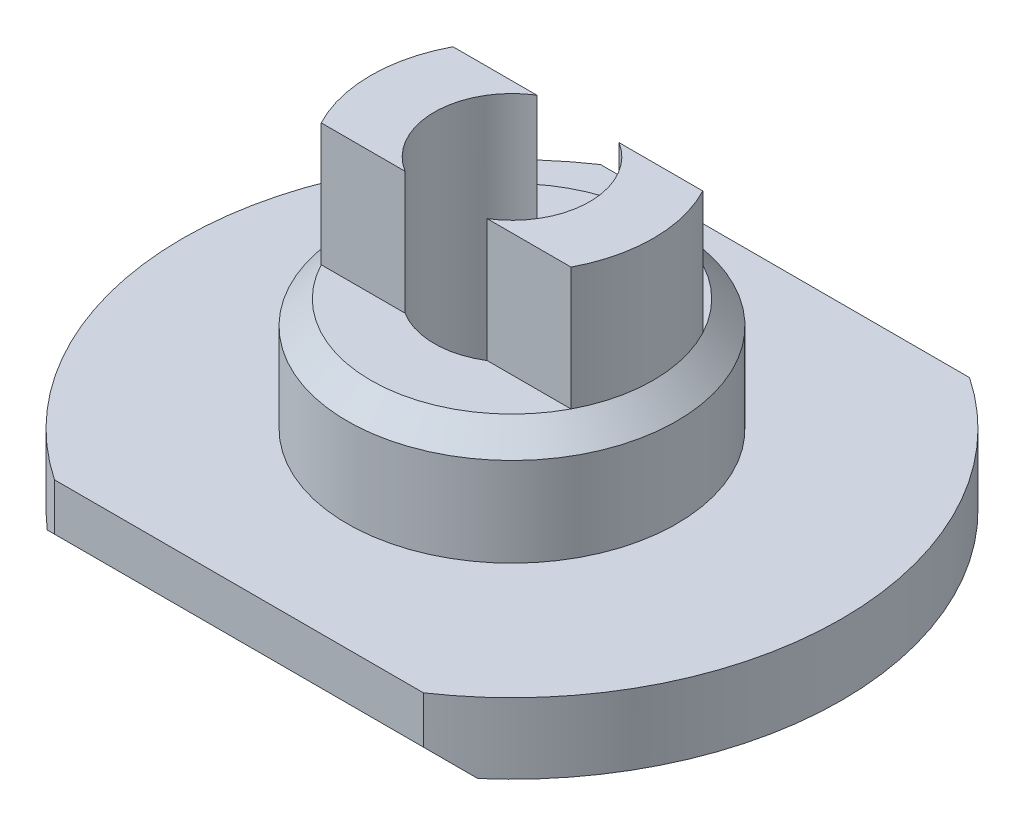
ISO-10303-21;
HEADER;
FILE_DESCRIPTION(('STEP AP214'),'2;1');
FILE_NAME('part.step','',(''),(''),'','','');
FILE_SCHEMA(('AUTOMOTIVE_DESIGN { 1 0 10303 214 1 1 1 1 }'));
ENDSEC;
DATA;
#1=APPLICATION_CONTEXT('core data for automotive mechanical design processes');
#2=APPLICATION_PROTOCOL_DEFINITION('international standard','automotive_design',2000,#1);
#3=PRODUCT_CONTEXT('',#1,'mechanical');
#4=PRODUCT('Part','Part','',(#3));
#5=PRODUCT_RELATED_PRODUCT_CATEGORY('part','',(#4));
#6=PRODUCT_DEFINITION_FORMATION('','',#4);
#7=PRODUCT_DEFINITION_CONTEXT('part definition',#1,'design');
#8=PRODUCT_DEFINITION('design','',#6,#7);
#9=PRODUCT_DEFINITION_SHAPE('','',#8);
#10=(LENGTH_UNIT() NAMED_UNIT(*) SI_UNIT(.MILLI.,.METRE.));
#11=(NAMED_UNIT(*) PLANE_ANGLE_UNIT() SI_UNIT($,.RADIAN.));
#12=(NAMED_UNIT(*) SI_UNIT($,.STERADIAN.) SOLID_ANGLE_UNIT());
#13=UNCERTAINTY_MEASURE_WITH_UNIT(LENGTH_MEASURE(1.E-05),#10,'distance_accuracy_value','');
#14=(GEOMETRIC_REPRESENTATION_CONTEXT(3) GLOBAL_UNCERTAINTY_ASSIGNED_CONTEXT((#13)) GLOBAL_UNIT_ASSIGNED_CONTEXT((#10,
#11,#12)) REPRESENTATION_CONTEXT('',''));
#15=CARTESIAN_POINT('',(0.,0.,0.));
#16=DIRECTION('',(0.,0.,1.));
#17=DIRECTION('',(1.,0.,0.));
#18=AXIS2_PLACEMENT_3D('',#15,#16,#17);
#19=CARTESIAN_POINT('',(0.,7.79999999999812,0.));
#20=DIRECTION('',(0.,-1.,0.));
#21=DIRECTION('',(0.,0.,-1.));
#22=AXIS2_PLACEMENT_3D('',#19,#20,#21);
#23=CYLINDRICAL_SURFACE('',#22,3.);
#24=DIRECTION('',(0.,1.,0.));
#25=VECTOR('',#24,1.);
#26=CARTESIAN_POINT('',(2.65329983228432,5.18908147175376,1.4));
#27=LINE('',#26,#25);
#28=CARTESIAN_POINT('',(2.65329983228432,7.79999999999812,1.4));
#29=VERTEX_POINT('',#28);
#30=CARTESIAN_POINT('',(2.65329983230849,5.18908147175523,1.4));
#31=VERTEX_POINT('',#30);
#32=EDGE_CURVE('E172',#29,#31,#27,.F.);
#33=ORIENTED_EDGE('',*,*,#32,.T.);
#34=CARTESIAN_POINT('',(0.,5.18908147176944,0.));
#35=DIRECTION('',(0.,-1.,0.));
#36=DIRECTION('',(0.,0.,-1.));
#37=AXIS2_PLACEMENT_3D('',#34,#35,#36);
#38=CIRCLE('',#37,3.00000000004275);
#39=CARTESIAN_POINT('',(2.65329983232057,5.1890814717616,-1.4));
#40=VERTEX_POINT('',#39);
#41=EDGE_CURVE('E168',#40,#31,#38,.T.);
#42=ORIENTED_EDGE('',*,*,#41,.F.);
#43=DIRECTION('',(0.,-1.,0.));
#44=VECTOR('',#43,1.);
#45=CARTESIAN_POINT('',(2.65329983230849,5.18908147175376,-1.4));
#46=LINE('',#45,#44);
#47=CARTESIAN_POINT('',(2.65329983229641,7.79999999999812,-1.4));
#48=VERTEX_POINT('',#47);
#49=EDGE_CURVE('E179',#40,#48,#46,.F.);
#50=ORIENTED_EDGE('',*,*,#49,.T.);
#51=CARTESIAN_POINT('',(0.,7.79999999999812,0.));
#52=DIRECTION('',(0.,-1.,0.));
#53=DIRECTION('',(0.,0.,-1.));
#54=AXIS2_PLACEMENT_3D('',#51,#52,#53);
#55=CIRCLE('',#54,3.);
#56=EDGE_CURVE('E182',#29,#48,#55,.F.);
#57=ORIENTED_EDGE('',*,*,#56,.F.);
#58=EDGE_LOOP('',(#33,#42,#50,#57));
#59=FACE_BOUND('',#58,.T.);
#60=ADVANCED_FACE('F17',(#59),#23,.T.);
#61=CARTESIAN_POINT('',(-7.,5.18908147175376,1.4));
#62=DIRECTION('',(0.,-1.,0.));
#63=DIRECTION('',(0.,0.,-1.));
#64=AXIS2_PLACEMENT_3D('',#61,#62,#63);
#65=PLANE('',#64);
#66=DIRECTION('',(1.,0.,0.));
#67=VECTOR('',#66,1.);
#68=CARTESIAN_POINT('',(-7.,5.18908147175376,1.4));
#69=LINE('',#68,#67);
#70=CARTESIAN_POINT('',(-0.873212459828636,5.18908147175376,1.4));
#71=VERTEX_POINT('',#70);
#72=CARTESIAN_POINT('',(-2.65329983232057,5.1890814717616,1.4));
#73=VERTEX_POINT('',#72);
#74=EDGE_CURVE('E116',#71,#73,#69,.F.);
#75=ORIENTED_EDGE('',*,*,#74,.T.);
#76=CARTESIAN_POINT('',(0.,5.18908147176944,0.));
#77=DIRECTION('',(0.,-1.,0.));
#78=DIRECTION('',(0.,0.,-1.));
#79=AXIS2_PLACEMENT_3D('',#76,#77,#78);
#80=CIRCLE('',#79,3.00000000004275);
#81=EDGE_CURVE('E167',#31,#73,#80,.T.);
#82=ORIENTED_EDGE('',*,*,#81,.F.);
#83=DIRECTION('',(1.,0.,0.));
#84=VECTOR('',#83,1.);
#85=CARTESIAN_POINT('',(-7.,5.18908147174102,1.4));
#86=LINE('',#85,#84);
#87=CARTESIAN_POINT('',(0.873212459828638,5.18908147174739,1.4));
#88=VERTEX_POINT('',#87);
#89=EDGE_CURVE('E119',#31,#88,#86,.F.);
#90=ORIENTED_EDGE('',*,*,#89,.T.);
#91=CARTESIAN_POINT('',(0.,5.18908147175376,0.));
#92=DIRECTION('',(0.,-1.,0.));
#93=DIRECTION('',(0.,0.,-1.));
#94=AXIS2_PLACEMENT_3D('',#91,#92,#93);
#95=CIRCLE('',#94,1.64999999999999);
#96=EDGE_CURVE('E20',#71,#88,#95,.F.);
#97=ORIENTED_EDGE('',*,*,#96,.F.);
#98=EDGE_LOOP('',(#75,#82,#90,#97));
#99=FACE_BOUND('',#98,.T.);
#100=ADVANCED_FACE('F115',(#99),#65,.F.);
#101=CARTESIAN_POINT('',(0.,7.79999999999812,0.));
#102=DIRECTION('',(0.,-1.,0.));
#103=DIRECTION('',(0.,0.,-1.));
#104=AXIS2_PLACEMENT_3D('',#101,#102,#103);
#105=CYLINDRICAL_SURFACE('',#104,3.);
#106=DIRECTION('',(0.,1.,0.));
#107=VECTOR('',#106,1.);
#108=CARTESIAN_POINT('',(-2.65329983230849,5.18908147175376,1.4));
#109=LINE('',#108,#107);
#110=CARTESIAN_POINT('',(-2.65329983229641,7.79999999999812,1.4));
#111=VERTEX_POINT('',#110);
#112=EDGE_CURVE('E132',#73,#111,#109,.T.);
#113=ORIENTED_EDGE('',*,*,#112,.T.);
#114=CARTESIAN_POINT('',(0.,7.79999999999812,0.));
#115=DIRECTION('',(0.,-1.,0.));
#116=DIRECTION('',(0.,0.,-1.));
#117=AXIS2_PLACEMENT_3D('',#114,#115,#116);
#118=CIRCLE('',#117,3.);
#119=CARTESIAN_POINT('',(-2.65329983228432,7.79999999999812,-1.4));
#120=VERTEX_POINT('',#119);
#121=EDGE_CURVE('E192',#120,#111,#118,.F.);
#122=ORIENTED_EDGE('',*,*,#121,.F.);
#123=DIRECTION('',(0.,-1.,0.));
#124=VECTOR('',#123,1.);
#125=CARTESIAN_POINT('',(-2.65329983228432,5.18908147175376,-1.4));
#126=LINE('',#125,#124);
#127=CARTESIAN_POINT('',(-2.65329983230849,5.18908147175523,-1.4));
#128=VERTEX_POINT('',#127);
#129=EDGE_CURVE('E159',#120,#128,#126,.T.);
#130=ORIENTED_EDGE('',*,*,#129,.T.);
#131=CARTESIAN_POINT('',(0.,5.18908147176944,0.));
#132=DIRECTION('',(0.,-1.,0.));
#133=DIRECTION('',(0.,0.,-1.));
#134=AXIS2_PLACEMENT_3D('',#131,#132,#133);
#135=CIRCLE('',#134,3.00000000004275);
#136=EDGE_CURVE('E149',#73,#128,#135,.T.);
#137=ORIENTED_EDGE('',*,*,#136,.F.);
#138=EDGE_LOOP('',(#113,#122,#130,#137));
#139=FACE_BOUND('',#138,.T.);
#140=ADVANCED_FACE('F532',(#139),#105,.T.);
#141=CARTESIAN_POINT('',(-7.,5.18908147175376,-1.4));
#142=DIRECTION('',(0.,-1.,0.));
#143=DIRECTION('',(0.,0.,-1.));
#144=AXIS2_PLACEMENT_3D('',#141,#142,#143);
#145=PLANE('',#144);
#146=DIRECTION('',(1.,0.,0.));
#147=VECTOR('',#146,1.);
#148=CARTESIAN_POINT('',(-7.,5.18908147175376,-1.4));
#149=LINE('',#148,#147);
#150=CARTESIAN_POINT('',(0.873212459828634,5.18908147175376,-1.4));
#151=VERTEX_POINT('',#150);
#152=EDGE_CURVE('E183',#151,#40,#149,.T.);
#153=ORIENTED_EDGE('',*,*,#152,.T.);
#154=CARTESIAN_POINT('',(0.,5.18908147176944,0.));
#155=DIRECTION('',(0.,-1.,0.));
#156=DIRECTION('',(0.,0.,-1.));
#157=AXIS2_PLACEMENT_3D('',#154,#155,#156);
#158=CIRCLE('',#157,3.00000000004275);
#159=EDGE_CURVE('E141',#128,#40,#158,.T.);
#160=ORIENTED_EDGE('',*,*,#159,.F.);
#161=DIRECTION('',(1.,0.,0.));
#162=VECTOR('',#161,1.);
#163=CARTESIAN_POINT('',(-7.,5.18908147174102,-1.4));
#164=LINE('',#163,#162);
#165=CARTESIAN_POINT('',(-0.87321245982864,5.18908147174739,-1.4));
#166=VERTEX_POINT('',#165);
#167=EDGE_CURVE('E186',#128,#166,#164,.T.);
#168=ORIENTED_EDGE('',*,*,#167,.T.);
#169=CARTESIAN_POINT('',(0.,5.18908147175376,0.));
#170=DIRECTION('',(0.,-1.,0.));
#171=DIRECTION('',(0.,0.,-1.));
#172=AXIS2_PLACEMENT_3D('',#169,#170,#171);
#173=CIRCLE('',#172,1.64999999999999);
#174=EDGE_CURVE('E125',#151,#166,#173,.F.);
#175=ORIENTED_EDGE('',*,*,#174,.F.);
#176=EDGE_LOOP('',(#153,#160,#168,#175));
#177=FACE_BOUND('',#176,.T.);
#178=ADVANCED_FACE('F269',(#177),#145,.F.);
#179=CARTESIAN_POINT('',(-7.,5.18908147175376,1.4));
#180=DIRECTION('',(0.,0.,-1.));
#181=DIRECTION('',(0.,1.,0.));
#182=AXIS2_PLACEMENT_3D('',#179,#180,#181);
#183=PLANE('',#182);
#184=DIRECTION('',(1.,0.,0.));
#185=VECTOR('',#184,1.);
#186=CARTESIAN_POINT('',(0.,7.79999999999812,1.4));
#187=LINE('',#186,#185);
#188=CARTESIAN_POINT('',(-0.873212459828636,7.79999999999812,1.4));
#189=VERTEX_POINT('',#188);
#190=EDGE_CURVE('E153',#111,#189,#187,.T.);
#191=ORIENTED_EDGE('',*,*,#190,.F.);
#192=ORIENTED_EDGE('',*,*,#112,.F.);
#193=ORIENTED_EDGE('',*,*,#74,.F.);
#194=DIRECTION('',(0.,-1.,0.));
#195=VECTOR('',#194,1.);
#196=CARTESIAN_POINT('',(-0.873212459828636,0.,1.4));
#197=LINE('',#196,#195);
#198=EDGE_CURVE('E130',#71,#189,#197,.F.);
#199=ORIENTED_EDGE('',*,*,#198,.T.);
#200=EDGE_LOOP('',(#191,#192,#193,#199));
#201=FACE_BOUND('',#200,.T.);
#202=ADVANCED_FACE('F129',(#201),#183,.F.);
#203=CARTESIAN_POINT('',(0.,7.79999999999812,0.));
#204=DIRECTION('',(0.,1.,0.));
#205=DIRECTION('',(0.,0.,1.));
#206=AXIS2_PLACEMENT_3D('',#203,#204,#205);
#207=PLANE('',#206);
#208=ORIENTED_EDGE('',*,*,#190,.T.);
#209=CARTESIAN_POINT('',(0.,7.79999999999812,0.));
#210=DIRECTION('',(0.,-1.,0.));
#211=DIRECTION('',(0.,0.,-1.));
#212=AXIS2_PLACEMENT_3D('',#209,#210,#211);
#213=CIRCLE('',#212,1.64999999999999);
#214=CARTESIAN_POINT('',(-0.873212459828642,7.79999999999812,-1.4));
#215=VERTEX_POINT('',#214);
#216=EDGE_CURVE('E139',#189,#215,#213,.T.);
#217=ORIENTED_EDGE('',*,*,#216,.T.);
#218=DIRECTION('',(1.,0.,0.));
#219=VECTOR('',#218,1.);
#220=CARTESIAN_POINT('',(-7.,7.79999999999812,-1.4));
#221=LINE('',#220,#219);
#222=EDGE_CURVE('E155',#215,#120,#221,.F.);
#223=ORIENTED_EDGE('',*,*,#222,.T.);
#224=ORIENTED_EDGE('',*,*,#121,.T.);
#225=EDGE_LOOP('',(#208,#217,#223,#224));
#226=FACE_BOUND('',#225,.T.);
#227=ADVANCED_FACE('F275',(#226),#207,.T.);
#228=CARTESIAN_POINT('',(-7.,5.18908147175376,-1.4));
#229=DIRECTION('',(0.,0.,1.));
#230=DIRECTION('',(0.,-1.,0.));
#231=AXIS2_PLACEMENT_3D('',#228,#229,#230);
#232=PLANE('',#231);
#233=ORIENTED_EDGE('',*,*,#167,.F.);
#234=ORIENTED_EDGE('',*,*,#129,.F.);
#235=ORIENTED_EDGE('',*,*,#222,.F.);
#236=DIRECTION('',(0.,-1.,0.));
#237=VECTOR('',#236,1.);
#238=CARTESIAN_POINT('',(-0.873212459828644,0.,-1.4));
#239=LINE('',#238,#237);
#240=EDGE_CURVE('E147',#215,#166,#239,.T.);
#241=ORIENTED_EDGE('',*,*,#240,.T.);
#242=EDGE_LOOP('',(#233,#234,#235,#241));
#243=FACE_BOUND('',#242,.T.);
#244=ADVANCED_FACE('F273',(#243),#232,.F.);
#245=CARTESIAN_POINT('',(-7.,5.18908147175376,-1.4));
#246=DIRECTION('',(0.,0.,1.));
#247=DIRECTION('',(0.,-1.,0.));
#248=AXIS2_PLACEMENT_3D('',#245,#246,#247);
#249=PLANE('',#248);
#250=DIRECTION('',(1.,0.,0.));
#251=VECTOR('',#250,1.);
#252=CARTESIAN_POINT('',(0.,7.79999999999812,-1.4));
#253=LINE('',#252,#251);
#254=CARTESIAN_POINT('',(0.873212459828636,7.79999999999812,-1.4));
#255=VERTEX_POINT('',#254);
#256=EDGE_CURVE('E257',#48,#255,#253,.F.);
#257=ORIENTED_EDGE('',*,*,#256,.F.);
#258=ORIENTED_EDGE('',*,*,#49,.F.);
#259=ORIENTED_EDGE('',*,*,#152,.F.);
#260=DIRECTION('',(0.,-1.,0.));
#261=VECTOR('',#260,1.);
#262=CARTESIAN_POINT('',(0.873212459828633,0.,-1.4));
#263=LINE('',#262,#261);
#264=EDGE_CURVE('E162',#151,#255,#263,.F.);
#265=ORIENTED_EDGE('',*,*,#264,.T.);
#266=EDGE_LOOP('',(#257,#258,#259,#265));
#267=FACE_BOUND('',#266,.T.);
#268=ADVANCED_FACE('F490',(#267),#249,.F.);
#269=CARTESIAN_POINT('',(0.,7.79999999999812,0.));
#270=DIRECTION('',(0.,1.,0.));
#271=DIRECTION('',(0.,0.,1.));
#272=AXIS2_PLACEMENT_3D('',#269,#270,#271);
#273=PLANE('',#272);
#274=ORIENTED_EDGE('',*,*,#256,.T.);
#275=CARTESIAN_POINT('',(0.,7.79999999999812,0.));
#276=DIRECTION('',(0.,-1.,0.));
#277=DIRECTION('',(0.,0.,-1.));
#278=AXIS2_PLACEMENT_3D('',#275,#276,#277);
#279=CIRCLE('',#278,1.64999999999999);
#280=CARTESIAN_POINT('',(0.873212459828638,7.79999999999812,1.4));
#281=VERTEX_POINT('',#280);
#282=EDGE_CURVE('E248',#255,#281,#279,.T.);
#283=ORIENTED_EDGE('',*,*,#282,.T.);
#284=DIRECTION('',(1.,0.,0.));
#285=VECTOR('',#284,1.);
#286=CARTESIAN_POINT('',(-7.,7.79999999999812,1.4));
#287=LINE('',#286,#285);
#288=EDGE_CURVE('E176',#281,#29,#287,.T.);
#289=ORIENTED_EDGE('',*,*,#288,.T.);
#290=ORIENTED_EDGE('',*,*,#56,.T.);
#291=EDGE_LOOP('',(#274,#283,#289,#290));
#292=FACE_BOUND('',#291,.T.);
#293=ADVANCED_FACE('F481',(#292),#273,.T.);
#294=CARTESIAN_POINT('',(-7.,5.18908147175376,1.4));
#295=DIRECTION('',(0.,0.,-1.));
#296=DIRECTION('',(0.,1.,0.));
#297=AXIS2_PLACEMENT_3D('',#294,#295,#296);
#298=PLANE('',#297);
#299=ORIENTED_EDGE('',*,*,#89,.F.);
#300=ORIENTED_EDGE('',*,*,#32,.F.);
#301=ORIENTED_EDGE('',*,*,#288,.F.);
#302=DIRECTION('',(0.,-1.,0.));
#303=VECTOR('',#302,1.);
#304=CARTESIAN_POINT('',(0.87321245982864,0.,1.4));
#305=LINE('',#304,#303);
#306=EDGE_CURVE('E250',#281,#88,#305,.T.);
#307=ORIENTED_EDGE('',*,*,#306,.T.);
#308=EDGE_LOOP('',(#299,#300,#301,#307));
#309=FACE_BOUND('',#308,.T.);
#310=ADVANCED_FACE('F471',(#309),#298,.F.);
#311=CARTESIAN_POINT('',(0.,4.68908147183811,0.));
#312=DIRECTION('',(0.,-1.,0.));
#313=DIRECTION('',(0.,0.,-1.));
#314=AXIS2_PLACEMENT_3D('',#311,#312,#313);
#315=CONICAL_SURFACE('',#314,3.49999999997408,0.785398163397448);
#316=ORIENTED_EDGE('',*,*,#41,.T.);
#317=ORIENTED_EDGE('',*,*,#81,.T.);
#318=ORIENTED_EDGE('',*,*,#136,.T.);
#319=ORIENTED_EDGE('',*,*,#159,.T.);
#320=EDGE_LOOP('',(#316,#317,#318,#319));
#321=FACE_BOUND('',#320,.T.);
#322=CARTESIAN_POINT('',(0.,4.68908147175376,0.));
#323=DIRECTION('',(0.,-1.,0.));
#324=DIRECTION('',(0.,0.,-1.));
#325=AXIS2_PLACEMENT_3D('',#322,#323,#324);
#326=CIRCLE('',#325,3.5);
#327=CARTESIAN_POINT('',(0.,4.68908147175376,-3.5));
#328=VERTEX_POINT('',#327);
#329=EDGE_CURVE('E247',#328,#328,#326,.T.);
#330=ORIENTED_EDGE('',*,*,#329,.F.);
#331=EDGE_LOOP('',(#330));
#332=FACE_BOUND('',#331,.T.);
#333=ADVANCED_FACE('F462',(#321,#332),#315,.T.);
#334=CARTESIAN_POINT('',(0.,0.,0.));
#335=DIRECTION('',(0.,-1.,0.));
#336=DIRECTION('',(0.,0.,-1.));
#337=AXIS2_PLACEMENT_3D('',#334,#335,#336);
#338=CYLINDRICAL_SURFACE('',#337,1.64999999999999);
#339=ORIENTED_EDGE('',*,*,#174,.T.);
#340=ORIENTED_EDGE('',*,*,#240,.F.);
#341=ORIENTED_EDGE('',*,*,#216,.F.);
#342=ORIENTED_EDGE('',*,*,#198,.F.);
#343=ORIENTED_EDGE('',*,*,#96,.T.);
#344=ORIENTED_EDGE('',*,*,#306,.F.);
#345=ORIENTED_EDGE('',*,*,#282,.F.);
#346=ORIENTED_EDGE('',*,*,#264,.F.);
#347=EDGE_LOOP('',(#339,#340,#341,#342,#343,#344,#345,#346));
#348=FACE_BOUND('',#347,.T.);
#349=CARTESIAN_POINT('',(0.,0.,0.));
#350=DIRECTION('',(0.,-1.,0.));
#351=DIRECTION('',(0.,0.,-1.));
#352=AXIS2_PLACEMENT_3D('',#349,#350,#351);
#353=CIRCLE('',#352,1.64999999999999);
#354=CARTESIAN_POINT('',(0.,0.,-1.64999999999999));
#355=VERTEX_POINT('',#354);
#356=EDGE_CURVE('E243',#355,#355,#353,.F.);
#357=ORIENTED_EDGE('',*,*,#356,.F.);
#358=EDGE_LOOP('',(#357));
#359=FACE_BOUND('',#358,.T.);
#360=ADVANCED_FACE('F136',(#348,#359),#338,.F.);
#361=CARTESIAN_POINT('',(0.,0.,0.));
#362=DIRECTION('',(0.,-1.,0.));
#363=DIRECTION('',(0.,0.,-1.));
#364=AXIS2_PLACEMENT_3D('',#361,#362,#363);
#365=CYLINDRICAL_SURFACE('',#364,3.5);
#366=ORIENTED_EDGE('',*,*,#329,.T.);
#367=EDGE_LOOP('',(#366));
#368=FACE_BOUND('',#367,.T.);
#369=CARTESIAN_POINT('',(0.,2.8,0.));
#370=DIRECTION('',(0.,-1.,0.));
#371=DIRECTION('',(0.,0.,-1.));
#372=AXIS2_PLACEMENT_3D('',#369,#370,#371);
#373=CIRCLE('',#372,3.5);
#374=CARTESIAN_POINT('',(0.,2.8,-3.5));
#375=VERTEX_POINT('',#374);
#376=EDGE_CURVE('E237',#375,#375,#373,.T.);
#377=ORIENTED_EDGE('',*,*,#376,.F.);
#378=EDGE_LOOP('',(#377));
#379=FACE_BOUND('',#378,.T.);
#380=ADVANCED_FACE('F444',(#368,#379),#365,.T.);
#381=CARTESIAN_POINT('',(0.,0.,-2.7));
#382=DIRECTION('',(0.,-1.,0.));
#383=DIRECTION('',(0.,0.,-1.));
#384=AXIS2_PLACEMENT_3D('',#381,#382,#383);
#385=PLANE('',#384);
#386=ORIENTED_EDGE('',*,*,#356,.T.);
#387=EDGE_LOOP('',(#386));
#388=FACE_BOUND('',#387,.T.);
#389=CARTESIAN_POINT('',(0.,0.,0.));
#390=DIRECTION('',(0.,-1.,0.));
#391=DIRECTION('',(0.,0.,-1.));
#392=AXIS2_PLACEMENT_3D('',#389,#390,#391);
#393=CIRCLE('',#392,2.7);
#394=CARTESIAN_POINT('',(0.,0.,-2.7));
#395=VERTEX_POINT('',#394);
#396=EDGE_CURVE('E231',#395,#395,#393,.F.);
#397=ORIENTED_EDGE('',*,*,#396,.F.);
#398=EDGE_LOOP('',(#397));
#399=FACE_BOUND('',#398,.T.);
#400=ADVANCED_FACE('F434',(#388,#399),#385,.T.);
#401=CARTESIAN_POINT('',(-7.,1.3,-5.80000000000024));
#402=DIRECTION('',(0.,0.,1.));
#403=DIRECTION('',(1.,0.,0.));
#404=AXIS2_PLACEMENT_3D('',#401,#402,#403);
#405=PLANE('',#404);
#406=DIRECTION('',(0.,-1.,0.));
#407=VECTOR('',#406,1.);
#408=CARTESIAN_POINT('',(-3.91918358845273,7.79999999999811,-5.80000000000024));
#409=LINE('',#408,#407);
#410=CARTESIAN_POINT('',(-3.91918358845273,2.8,-5.80000000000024));
#411=VERTEX_POINT('',#410);
#412=CARTESIAN_POINT('',(-3.91918358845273,1.8,-5.80000000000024));
#413=VERTEX_POINT('',#412);
#414=EDGE_CURVE('E235',#411,#413,#409,.T.);
#415=ORIENTED_EDGE('',*,*,#414,.F.);
#416=DIRECTION('',(1.,0.,0.));
#417=VECTOR('',#416,1.);
#418=CARTESIAN_POINT('',(0.,2.8,-5.80000000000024));
#419=LINE('',#418,#417);
#420=CARTESIAN_POINT('',(3.91918358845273,2.8,-5.80000000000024));
#421=VERTEX_POINT('',#420);
#422=EDGE_CURVE('E241',#421,#411,#419,.F.);
#423=ORIENTED_EDGE('',*,*,#422,.F.);
#424=DIRECTION('',(0.,1.,0.));
#425=VECTOR('',#424,1.);
#426=CARTESIAN_POINT('',(3.91918358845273,1.3,-5.80000000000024));
#427=LINE('',#426,#425);
#428=CARTESIAN_POINT('',(3.91918358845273,1.8,-5.80000000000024));
#429=VERTEX_POINT('',#428);
#430=EDGE_CURVE('E242',#429,#421,#427,.T.);
#431=ORIENTED_EDGE('',*,*,#430,.F.);
#432=DIRECTION('',(1.,0.,0.));
#433=VECTOR('',#432,1.);
#434=CARTESIAN_POINT('',(-7.,1.8,-5.80000000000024));
#435=LINE('',#434,#433);
#436=EDGE_CURVE('E221',#413,#429,#435,.T.);
#437=ORIENTED_EDGE('',*,*,#436,.F.);
#438=EDGE_LOOP('',(#415,#423,#431,#437));
#439=FACE_BOUND('',#438,.T.);
#440=ADVANCED_FACE('F424',(#439),#405,.F.);
#441=CARTESIAN_POINT('',(0.,2.8,-7.));
#442=DIRECTION('',(0.,1.,0.));
#443=DIRECTION('',(0.,0.,1.));
#444=AXIS2_PLACEMENT_3D('',#441,#442,#443);
#445=PLANE('',#444);
#446=CARTESIAN_POINT('',(0.,2.8,0.));
#447=DIRECTION('',(0.,-1.,0.));
#448=DIRECTION('',(0.,0.,-1.));
#449=AXIS2_PLACEMENT_3D('',#446,#447,#448);
#450=CIRCLE('',#449,7.);
#451=CARTESIAN_POINT('',(3.91918358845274,2.8,5.80000000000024));
#452=VERTEX_POINT('',#451);
#453=EDGE_CURVE('E217',#421,#452,#450,.T.);
#454=ORIENTED_EDGE('',*,*,#453,.F.);
#455=ORIENTED_EDGE('',*,*,#422,.T.);
#456=CARTESIAN_POINT('',(0.,2.8,0.));
#457=DIRECTION('',(0.,-1.,0.));
#458=DIRECTION('',(0.,0.,-1.));
#459=AXIS2_PLACEMENT_3D('',#456,#457,#458);
#460=CIRCLE('',#459,7.);
#461=CARTESIAN_POINT('',(-3.91918358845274,2.8,5.80000000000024));
#462=VERTEX_POINT('',#461);
#463=EDGE_CURVE('E226',#462,#411,#460,.T.);
#464=ORIENTED_EDGE('',*,*,#463,.F.);
#465=DIRECTION('',(-1.,0.,0.));
#466=VECTOR('',#465,1.);
#467=CARTESIAN_POINT('',(-7.,2.8,5.80000000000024));
#468=LINE('',#467,#466);
#469=EDGE_CURVE('E236',#462,#452,#468,.F.);
#470=ORIENTED_EDGE('',*,*,#469,.T.);
#471=EDGE_LOOP('',(#454,#455,#464,#470));
#472=FACE_BOUND('',#471,.T.);
#473=ORIENTED_EDGE('',*,*,#376,.T.);
#474=EDGE_LOOP('',(#473));
#475=FACE_BOUND('',#474,.T.);
#476=ADVANCED_FACE('F414',(#472,#475),#445,.T.);
#477=CARTESIAN_POINT('',(-7.,1.3,5.80000000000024));
#478=DIRECTION('',(0.,0.,-1.));
#479=DIRECTION('',(-1.,0.,0.));
#480=AXIS2_PLACEMENT_3D('',#477,#478,#479);
#481=PLANE('',#480);
#482=DIRECTION('',(0.,-1.,0.));
#483=VECTOR('',#482,1.);
#484=CARTESIAN_POINT('',(3.91918358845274,7.79999999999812,5.80000000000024));
#485=LINE('',#484,#483);
#486=CARTESIAN_POINT('',(3.91918358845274,1.8,5.80000000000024));
#487=VERTEX_POINT('',#486);
#488=EDGE_CURVE('E216',#452,#487,#485,.T.);
#489=ORIENTED_EDGE('',*,*,#488,.F.);
#490=ORIENTED_EDGE('',*,*,#469,.F.);
#491=DIRECTION('',(0.,-1.,0.));
#492=VECTOR('',#491,1.);
#493=CARTESIAN_POINT('',(-3.91918358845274,7.79999999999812,5.80000000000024));
#494=LINE('',#493,#492);
#495=CARTESIAN_POINT('',(-3.91918358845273,1.8,5.80000000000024));
#496=VERTEX_POINT('',#495);
#497=EDGE_CURVE('E230',#496,#462,#494,.F.);
#498=ORIENTED_EDGE('',*,*,#497,.F.);
#499=DIRECTION('',(1.,0.,0.));
#500=VECTOR('',#499,1.);
#501=CARTESIAN_POINT('',(-7.,1.8,5.80000000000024));
#502=LINE('',#501,#500);
#503=EDGE_CURVE('E209',#487,#496,#502,.F.);
#504=ORIENTED_EDGE('',*,*,#503,.F.);
#505=EDGE_LOOP('',(#489,#490,#498,#504));
#506=FACE_BOUND('',#505,.T.);
#507=ADVANCED_FACE('F404',(#506),#481,.F.);
#508=CARTESIAN_POINT('',(0.,7.79999999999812,0.));
#509=DIRECTION('',(0.,-1.,0.));
#510=DIRECTION('',(0.,0.,-1.));
#511=AXIS2_PLACEMENT_3D('',#508,#509,#510);
#512=CYLINDRICAL_SURFACE('',#511,2.7);
#513=ORIENTED_EDGE('',*,*,#396,.T.);
#514=EDGE_LOOP('',(#513));
#515=FACE_BOUND('',#514,.T.);
#516=CARTESIAN_POINT('',(0.,1.3,0.));
#517=DIRECTION('',(0.,-1.,0.));
#518=DIRECTION('',(0.,0.,-1.));
#519=AXIS2_PLACEMENT_3D('',#516,#517,#518);
#520=CIRCLE('',#519,2.7);
#521=CARTESIAN_POINT('',(0.,1.3,-2.7));
#522=VERTEX_POINT('',#521);
#523=EDGE_CURVE('E201',#522,#522,#520,.F.);
#524=ORIENTED_EDGE('',*,*,#523,.F.);
#525=EDGE_LOOP('',(#524));
#526=FACE_BOUND('',#525,.T.);
#527=ADVANCED_FACE('F394',(#515,#526),#512,.T.);
#528=CARTESIAN_POINT('',(0.,7.79999999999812,0.));
#529=DIRECTION('',(0.,-1.,0.));
#530=DIRECTION('',(0.,0.,-1.));
#531=AXIS2_PLACEMENT_3D('',#528,#529,#530);
#532=CYLINDRICAL_SURFACE('',#531,7.);
#533=ORIENTED_EDGE('',*,*,#497,.T.);
#534=ORIENTED_EDGE('',*,*,#463,.T.);
#535=ORIENTED_EDGE('',*,*,#414,.T.);
#536=CARTESIAN_POINT('',(0.,-4.00000000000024,0.));
#537=DIRECTION('',(0.,-0.707106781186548,-0.707106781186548));
#538=DIRECTION('',(0.,-0.707106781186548,0.707106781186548));
#539=AXIS2_PLACEMENT_3D('',#536,#537,#538);
#540=ELLIPSE('',#539,9.89949493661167,7.);
#541=CARTESIAN_POINT('',(-4.5727453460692,1.3,-5.30000000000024));
#542=VERTEX_POINT('',#541);
#543=EDGE_CURVE('E222',#542,#413,#540,.T.);
#544=ORIENTED_EDGE('',*,*,#543,.F.);
#545=CARTESIAN_POINT('',(0.,1.3,0.));
#546=DIRECTION('',(0.,-1.,0.));
#547=DIRECTION('',(0.,0.,-1.));
#548=AXIS2_PLACEMENT_3D('',#545,#546,#547);
#549=CIRCLE('',#548,7.);
#550=CARTESIAN_POINT('',(-4.5727453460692,1.3,5.30000000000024));
#551=VERTEX_POINT('',#550);
#552=EDGE_CURVE('E197',#551,#542,#549,.T.);
#553=ORIENTED_EDGE('',*,*,#552,.F.);
#554=CARTESIAN_POINT('',(0.,-4.00000000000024,0.));
#555=DIRECTION('',(0.,-0.707106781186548,0.707106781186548));
#556=DIRECTION('',(0.,-0.707106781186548,-0.707106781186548));
#557=AXIS2_PLACEMENT_3D('',#554,#555,#556);
#558=ELLIPSE('',#557,9.89949493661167,7.);
#559=EDGE_CURVE('E205',#496,#551,#558,.T.);
#560=ORIENTED_EDGE('',*,*,#559,.F.);
#561=EDGE_LOOP('',(#533,#534,#535,#544,#553,#560));
#562=FACE_BOUND('',#561,.T.);
#563=ADVANCED_FACE('F360',(#562),#532,.T.);
#564=CARTESIAN_POINT('',(-7.,1.8,-5.80000000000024));
#565=DIRECTION('',(0.,-0.707106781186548,-0.707106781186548));
#566=DIRECTION('',(0.,0.707106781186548,-0.707106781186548));
#567=AXIS2_PLACEMENT_3D('',#564,#565,#566);
#568=PLANE('',#567);
#569=CARTESIAN_POINT('',(0.,-4.00000000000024,0.));
#570=DIRECTION('',(0.,-0.707106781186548,-0.707106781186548));
#571=DIRECTION('',(0.,-0.707106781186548,0.707106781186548));
#572=AXIS2_PLACEMENT_3D('',#569,#570,#571);
#573=ELLIPSE('',#572,9.89949493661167,7.);
#574=CARTESIAN_POINT('',(4.5727453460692,1.3,-5.30000000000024));
#575=VERTEX_POINT('',#574);
#576=EDGE_CURVE('E212',#575,#429,#573,.F.);
#577=ORIENTED_EDGE('',*,*,#576,.F.);
#578=DIRECTION('',(1.,0.,0.));
#579=VECTOR('',#578,1.);
#580=CARTESIAN_POINT('',(0.,1.3,-5.30000000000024));
#581=LINE('',#580,#579);
#582=EDGE_CURVE('E196',#542,#575,#581,.T.);
#583=ORIENTED_EDGE('',*,*,#582,.F.);
#584=ORIENTED_EDGE('',*,*,#543,.T.);
#585=ORIENTED_EDGE('',*,*,#436,.T.);
#586=EDGE_LOOP('',(#577,#583,#584,#585));
#587=FACE_BOUND('',#586,.T.);
#588=ADVANCED_FACE('F348',(#587),#568,.T.);
#589=CARTESIAN_POINT('',(0.,7.79999999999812,0.));
#590=DIRECTION('',(0.,-1.,0.));
#591=DIRECTION('',(0.,0.,-1.));
#592=AXIS2_PLACEMENT_3D('',#589,#590,#591);
#593=CYLINDRICAL_SURFACE('',#592,7.);
#594=CARTESIAN_POINT('',(0.,1.3,0.));
#595=DIRECTION('',(0.,-1.,0.));
#596=DIRECTION('',(0.,0.,-1.));
#597=AXIS2_PLACEMENT_3D('',#594,#595,#596);
#598=CIRCLE('',#597,7.);
#599=CARTESIAN_POINT('',(4.5727453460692,1.3,5.30000000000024));
#600=VERTEX_POINT('',#599);
#601=EDGE_CURVE('E27',#575,#600,#598,.T.);
#602=ORIENTED_EDGE('',*,*,#601,.F.);
#603=ORIENTED_EDGE('',*,*,#576,.T.);
#604=ORIENTED_EDGE('',*,*,#430,.T.);
#605=ORIENTED_EDGE('',*,*,#453,.T.);
#606=ORIENTED_EDGE('',*,*,#488,.T.);
#607=CARTESIAN_POINT('',(0.,-4.00000000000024,0.));
#608=DIRECTION('',(0.,-0.707106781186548,0.707106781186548));
#609=DIRECTION('',(0.,-0.707106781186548,-0.707106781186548));
#610=AXIS2_PLACEMENT_3D('',#607,#608,#609);
#611=ELLIPSE('',#610,9.89949493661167,7.);
#612=EDGE_CURVE('E36',#600,#487,#611,.T.);
#613=ORIENTED_EDGE('',*,*,#612,.F.);
#614=EDGE_LOOP('',(#602,#603,#604,#605,#606,#613));
#615=FACE_BOUND('',#614,.T.);
#616=ADVANCED_FACE('F350',(#615),#593,.T.);
#617=CARTESIAN_POINT('',(-7.,1.8,5.80000000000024));
#618=DIRECTION('',(0.,-0.707106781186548,0.707106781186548));
#619=DIRECTION('',(0.,-0.707106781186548,-0.707106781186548));
#620=AXIS2_PLACEMENT_3D('',#617,#618,#619);
#621=PLANE('',#620);
#622=ORIENTED_EDGE('',*,*,#559,.T.);
#623=DIRECTION('',(1.,0.,0.));
#624=VECTOR('',#623,1.);
#625=CARTESIAN_POINT('',(0.,1.3,5.30000000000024));
#626=LINE('',#625,#624);
#627=EDGE_CURVE('E11',#600,#551,#626,.F.);
#628=ORIENTED_EDGE('',*,*,#627,.F.);
#629=ORIENTED_EDGE('',*,*,#612,.T.);
#630=ORIENTED_EDGE('',*,*,#503,.T.);
#631=EDGE_LOOP('',(#622,#628,#629,#630));
#632=FACE_BOUND('',#631,.T.);
#633=ADVANCED_FACE('F352',(#632),#621,.T.);
#634=CARTESIAN_POINT('',(0.,1.3,-2.7));
#635=DIRECTION('',(0.,-1.,0.));
#636=DIRECTION('',(0.,0.,-1.));
#637=AXIS2_PLACEMENT_3D('',#634,#635,#636);
#638=PLANE('',#637);
#639=ORIENTED_EDGE('',*,*,#601,.T.);
#640=ORIENTED_EDGE('',*,*,#627,.T.);
#641=ORIENTED_EDGE('',*,*,#552,.T.);
#642=ORIENTED_EDGE('',*,*,#582,.T.);
#643=EDGE_LOOP('',(#639,#640,#641,#642));
#644=FACE_BOUND('',#643,.T.);
#645=ORIENTED_EDGE('',*,*,#523,.T.);
#646=EDGE_LOOP('',(#645));
#647=FACE_BOUND('',#646,.T.);
#648=ADVANCED_FACE('F344',(#644,#647),#638,.T.);
#649=CLOSED_SHELL('',(#60,#100,#140,#178,#202,#227,#244,#268,#293,#310,#333,#360,#380,#400,#440,
#476,#507,#527,#563,#588,#616,#633,#648));
#650=MANIFOLD_SOLID_BREP('B1',#649);
#651=ADVANCED_BREP_SHAPE_REPRESENTATION('',(#18,#650),#14);
#652=SHAPE_DEFINITION_REPRESENTATION(#9,#651);
ENDSEC;
END-ISO-10303-21;
